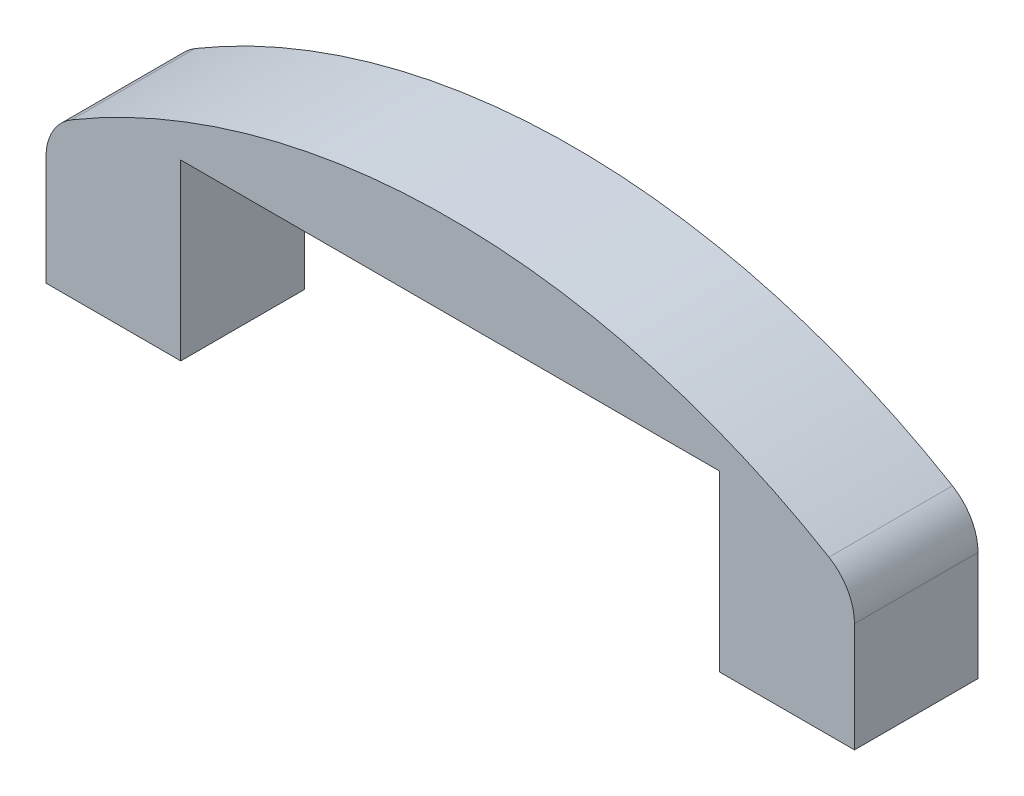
from build123d import *

# Parameters (mm, degrees)
BOSS_EXTRU_1_DEPTH      = 22
ESQUISSE2_W             = 96
ESQUISSE2_H             = 31
ENL_V_MAT_EXTRU_1_DEPTH = 142.50618361
CHANFREIN1_SIZE         = 0.5415
CONG_1_R                = 9.3


with BuildPart() as part:
    # Esquisse1 → Boss.-Extru.1 (new body)
    with BuildSketch(Plane.XY.offset(11)):
        with BuildLine():
            Line((-12, 24.634533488), (-12, 0))
            Line((-12, 0), (132, 0))
            Line((132, 0), (132, 24.634533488))
            ThreePointArc((132, 24.634533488), (60, 46), (-12, 24.634533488))
        make_face()
    extrude(amount=-BOSS_EXTRU_1_DEPTH)

    # Esquisse2 → Enl_v. mat.-Extru.1 (cut, through all)
    with BuildSketch(Plane(origin=(0, 0, -11), x_dir=(-1, 0, 0), z_dir=(0, 0, -1))):
        with Locations((-60, 15.5)):
            Rectangle(ESQUISSE2_W, ESQUISSE2_H)
    extrude(amount=-ENL_V_MAT_EXTRU_1_DEPTH, mode=Mode.SUBTRACT)

    # Esquisse3 → Enl_vement de mati_re-R_volution1 (revolve, cut)
    with BuildSketch(Plane(origin=(0, 0, 0), x_dir=(-1, 0, 0), z_dir=(0, 0, -1)), mode=Mode.PRIVATE) as enl_vement_de_mati_re_r_volution1_sk:
        Polygon((-2.4585, -1e-09), (0, -1e-09), (0, 18.219415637), (-2.4585, 16.8), (-2.4585, 12.5415), (-3, 12), (-2.4585, 12), align=None)
    revolve(enl_vement_de_mati_re_r_volution1_sk.sketch.rotate(Axis((0, -1e-09, 0), (0, 1, 0)), 270), axis=Axis((0, -1e-09, 0), (0, 1, 0)), mode=Mode.SUBTRACT)

    # Esquisse4 → Enl_vement de mati_re-R_volution2 (revolve, cut)
    with BuildSketch(Plane(origin=(0, 0, 0), x_dir=(-1, 0, 0), z_dir=(0, 0, -1)), mode=Mode.PRIVATE) as enl_vement_de_mati_re_r_volution2_sk:
        Polygon((-122.4585, -1e-09), (-120, -1e-09), (-120, 18.219415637), (-122.4585, 16.8), (-122.4585, 12.5415), (-123, 12), (-122.4585, 12), align=None)
    revolve(enl_vement_de_mati_re_r_volution2_sk.sketch.rotate(Axis((120, -1e-09, 0), (0, 1, 0)), 270), axis=Axis((120, -1e-09, 0), (0, 1, 0)), mode=Mode.SUBTRACT)

    # Chanfrein1
    chanfrein1_edges = [part.edges().sort_by_distance(p)[0] for p in [
        (0, -1e-09, -2.4585),
        (120, -1e-09, -2.4585),
    ]]
    chamfer(chanfrein1_edges, length=CHANFREIN1_SIZE)

    # Cong_1
    cong_1_edges = [part.edges().sort_by_distance(p)[0] for p in [
        (132, 24.634533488, 0),
        (-12, 24.634533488, 0),
    ]]
    fillet(cong_1_edges, radius=CONG_1_R)


solid = part.part
